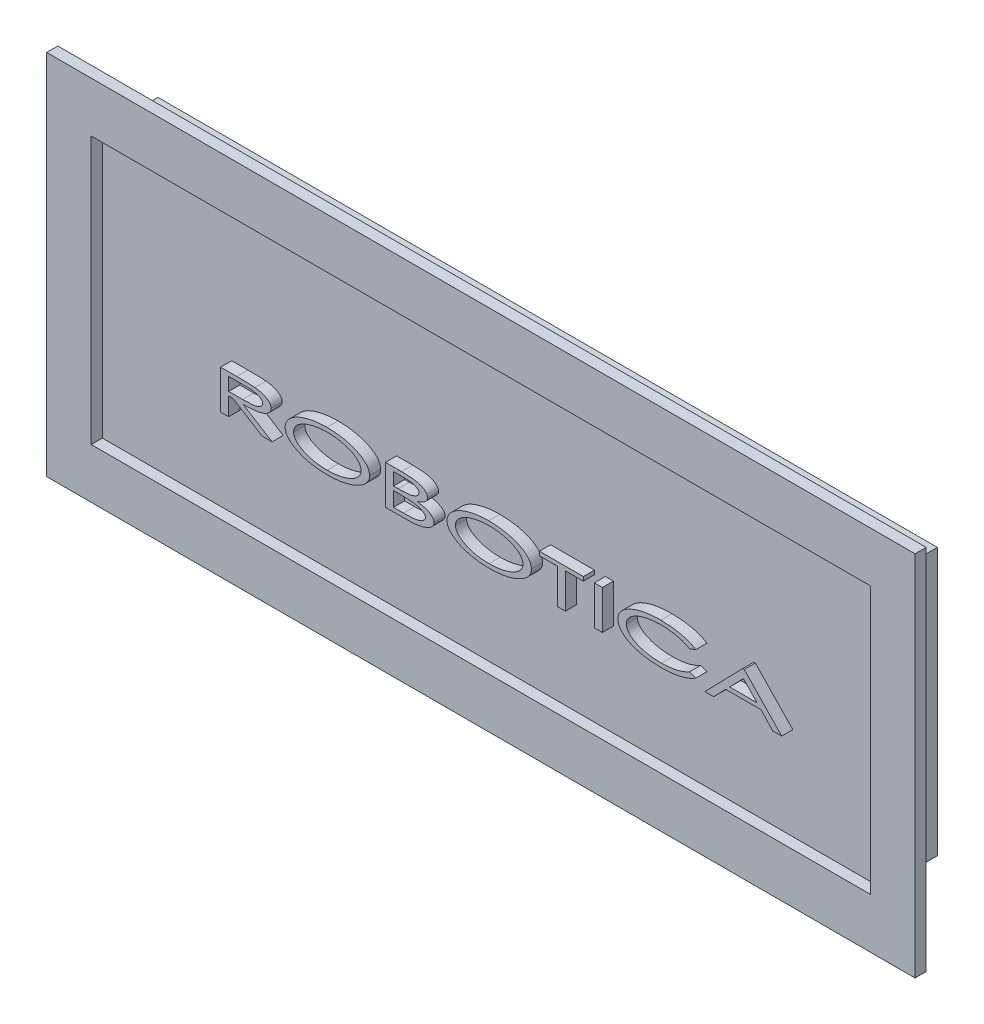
from build123d import *

# Parameters (mm, degrees)
CROQUIS1_W              = 70
CROQUIS1_H              = 24
SALIENTE_EXTRUIR1_DEPTH = 5
CROQUIS2_W              = 0.717948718
CROQUIS2_H              = 3.5
SALIENTE_EXTRUIR2_DEPTH = 1
CROQUIS3_W              = 78
CROQUIS3_H              = 33
CROQUIS3_W_2            = 70
CROQUIS3_H_2            = 24
SALIENTE_EXTRUIR3_DEPTH = 1


with BuildPart() as part:
    # Croquis1 → Saliente-Extruir1 (new body)
    with BuildSketch(Plane.XY):
        Rectangle(CROQUIS1_W, CROQUIS1_H)
    extrude(amount=SALIENTE_EXTRUIR1_DEPTH)

    # Croquis2 → Saliente-Extruir2 (add)
    # profile 1 of 8: a face of its own
    with BuildSketch(Plane.XY.offset(5)):
        with BuildLine():
            Line((-23.370996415, -0.16770114), (-21.92738664, -0.16770114))
            add(Edge.make_bspline(
                [(-21.92738664, -0.16770114), (-21.878074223, -0.167631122), (-21.781552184, -0.167494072), (-21.639926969, -0.168473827), (-21.504373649, -0.16892805), (-21.374896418, -0.17031254), (-21.25127106, -0.172586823), (-21.133949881, -0.174677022), (-21.02246308, -0.176628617), (-20.917288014, -0.179353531), (-20.817975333, -0.183051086), (-20.72495945, -0.186542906), (-20.638001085, -0.189859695), (-20.557126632, -0.194010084), (-20.482367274, -0.199134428), (-20.413609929, -0.20370786), (-20.351006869, -0.209520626), (-20.311298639, -0.213486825), (-20.292370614, -0.215377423)],
                knots=[0, 0, 0, 0, 1.446554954, 2.831425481, 4.154595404, 5.422975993, 6.629756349, 7.781699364, 8.865096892, 9.900672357, 10.867935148, 11.780388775, 12.631187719, 13.420666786, 14.155795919, 14.829367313, 15.441985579, 16, 16, 16, 16], degree=3))
            add(Edge.make_bspline(
                [(-20.292370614, -0.215377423), (-20.239717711, -0.221667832), (-20.136659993, -0.233980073), (-19.986553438, -0.260268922), (-19.843866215, -0.291090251), (-19.708613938, -0.32629599), (-19.581206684, -0.368014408), (-19.461131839, -0.414282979), (-19.348025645, -0.464864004), (-19.244183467, -0.521816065), (-19.149149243, -0.581019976), (-19.066983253, -0.645775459), (-18.996566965, -0.713154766), (-18.939024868, -0.784410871), (-18.894315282, -0.859238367), (-18.862114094, -0.937583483), (-18.842544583, -1.019540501), (-18.840149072, -1.075549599), (-18.838945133, -1.103698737)],
                knots=[0, 0, 0, 0, 1.380520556, 2.702097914, 3.966100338, 5.180878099, 6.339358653, 7.454764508, 8.530505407, 9.562535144, 10.536583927, 11.442314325, 12.28149152, 13.069345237, 13.819715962, 14.542946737, 15.26771195, 16, 16, 16, 16], degree=3))
            add(Edge.make_bspline(
                [(-18.838945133, -1.103698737), (-18.839669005, -1.127373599), (-18.841107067, -1.174406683), (-18.855285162, -1.243574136), (-18.87665269, -1.310740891), (-18.908486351, -1.375055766), (-18.947572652, -1.437623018), (-18.996212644, -1.497670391), (-19.052949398, -1.555988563), (-19.119183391, -1.610990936), (-19.192970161, -1.663372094), (-19.273909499, -1.713643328), (-19.363018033, -1.759400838), (-19.459232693, -1.802212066), (-19.563012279, -1.841479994), (-19.67413538, -1.877754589), (-19.79298956, -1.91066409), (-19.919966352, -1.940308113), (-20.056873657, -1.965975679), (-20.20500962, -1.98950754), (-20.365797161, -2.007681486), (-20.538744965, -2.023991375), (-20.724145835, -2.036409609), (-20.92190656, -2.045381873), (-21.132048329, -2.051037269), (-21.276274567, -2.051882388), (-21.350363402, -2.052316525)],
                knots=[0, 0, 0, 0, 0.585034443, 1.162244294, 1.740062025, 2.324524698, 2.932538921, 3.561952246, 4.232540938, 4.942531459, 5.688640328, 6.470118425, 7.297704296, 8.164845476, 9.074421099, 10.041713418, 11.055995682, 12.124753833, 13.266725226, 14.501606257, 15.834907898, 17.269296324, 18.799348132, 20.431667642, 22.166952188, 24, 24, 24, 24], degree=3))
            Line((-21.350363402, -2.052316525), (-18.749201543, -3.66770114))
            Line((-18.749201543, -3.66770114), (-19.658556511, -3.66770114))
            Line((-19.658556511, -3.66770114), (-22.259017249, -2.052316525))
            Line((-22.259017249, -2.052316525), (-22.653047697, -2.052316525))
            Line((-22.653047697, -2.052316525), (-22.653047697, -3.66770114))
            Line((-22.653047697, -3.66770114), (-23.370996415, -3.66770114))
            Line((-23.370996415, -3.66770114), (-23.370996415, -0.16770114))
        make_face()
        with BuildLine():
            Line((-22.653047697, -0.526675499), (-22.653047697, -1.693342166))
            Line((-22.653047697, -1.693342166), (-21.40785539, -1.698250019))
            add(Edge.make_bspline(
                [(-21.40785539, -1.698250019), (-21.349425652, -1.698268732), (-21.23676096, -1.698304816), (-21.073634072, -1.694279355), (-20.922159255, -1.689762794), (-20.782370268, -1.682832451), (-20.654487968, -1.673854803), (-20.538519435, -1.662714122), (-20.434184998, -1.649689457), (-20.340420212, -1.634104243), (-20.254790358, -1.616407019), (-20.175077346, -1.596070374), (-20.09997077, -1.573686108), (-20.029596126, -1.549343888), (-19.964216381, -1.522036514), (-19.903880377, -1.491865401), (-19.848249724, -1.459401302), (-19.797004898, -1.425511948), (-19.751516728, -1.388883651), (-19.711316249, -1.35160146), (-19.678345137, -1.312174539), (-19.649430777, -1.273390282), (-19.628456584, -1.231922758), (-19.612811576, -1.189900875), (-19.603242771, -1.146661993), (-19.602257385, -1.117533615), (-19.601765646, -1.102997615)],
                knots=[0, 0, 0, 0, 2.053767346, 3.960090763, 5.735463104, 7.380516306, 8.879456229, 10.241289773, 11.475236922, 12.574575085, 13.581541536, 14.547878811, 15.465351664, 16.335715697, 17.16416939, 17.954049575, 18.705037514, 19.427304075, 20.111126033, 20.756147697, 21.350473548, 21.915818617, 22.452252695, 22.977242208, 23.489610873, 24, 24, 24, 24], degree=3))
            add(Edge.make_bspline(
                [(-19.601765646, -1.102997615), (-19.602168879, -1.088675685), (-19.602972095, -1.060147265), (-19.613735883, -1.018267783), (-19.629257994, -0.977373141), (-19.650183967, -0.936812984), (-19.679049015, -0.898506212), (-19.712601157, -0.860267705), (-19.753187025, -0.823859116), (-19.81592643, -0.775647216), (-19.905998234, -0.719573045), (-20.029002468, -0.664963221), (-20.166564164, -0.619311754), (-20.292759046, -0.590631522), (-20.406182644, -0.572465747), (-20.506026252, -0.560007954), (-20.61920295, -0.549615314), (-20.745472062, -0.541575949), (-20.884994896, -0.534402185), (-21.037635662, -0.529723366), (-21.203583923, -0.526871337), (-21.318577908, -0.526742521), (-21.378408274, -0.526675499)],
                knots=[0, 0, 0, 0, 0.426524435, 0.849610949, 1.282423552, 1.7318453, 2.206347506, 2.710448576, 3.248780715, 3.830741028, 5.071764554, 6.405070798, 7.839224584, 9.392952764, 10.262421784, 11.268037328, 12.396234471, 13.654921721, 15.045140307, 16.566958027, 18.213818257, 20, 20, 20, 20], degree=3))
            Line((-21.378408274, -0.526675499), (-22.653047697, -0.526675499))
        make_face(mode=Mode.SUBTRACT)
    # profile 2 of 8: a face of its own
    with BuildSketch(Plane.XY.offset(5)):
        with BuildLine():
            add(Edge.make_bspline(
                [(-13.837142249, -0.077957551), (-13.769596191, -0.078355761), (-13.636110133, -0.079142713), (-13.437872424, -0.085584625), (-13.244114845, -0.096267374), (-13.05422189, -0.109849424), (-12.86862597, -0.128938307), (-12.687031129, -0.152189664), (-12.509536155, -0.178660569), (-12.336177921, -0.209222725), (-12.167322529, -0.245404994), (-12.002364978, -0.284352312), (-11.841734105, -0.327873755), (-11.685290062, -0.375521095), (-11.533034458, -0.427360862), (-11.384849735, -0.483650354), (-11.240615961, -0.543562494), (-11.101662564, -0.608054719), (-10.968856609, -0.674778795), (-10.844150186, -0.744342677), (-10.727445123, -0.814743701), (-10.61990148, -0.887913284), (-10.520733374, -0.962835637), (-10.430337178, -1.040067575), (-10.347760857, -1.118361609), (-10.274606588, -1.199381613), (-10.209725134, -1.282202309), (-10.153659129, -1.367180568), (-10.105309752, -1.453587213), (-10.066817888, -1.542496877), (-10.036102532, -1.633147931), (-10.015733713, -1.72608898), (-10.001315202, -1.820498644), (-9.999909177, -1.884225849), (-9.999201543, -1.916298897)],
                knots=[0, 0, 0, 0, 1.404451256, 2.77550855, 4.12354312, 5.439184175, 6.733600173, 8.002367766, 9.245594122, 10.464769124, 11.661827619, 12.83577003, 13.988643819, 15.121558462, 16.235683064, 17.332246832, 18.417021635, 19.482390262, 20.516844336, 21.506606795, 22.450850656, 23.349845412, 24.209978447, 25.033806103, 25.820868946, 26.574331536, 27.301429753, 28.00631532, 28.689285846, 29.357364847, 30.018140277, 30.675942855, 31.333619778, 32, 32, 32, 32], degree=3))
            add(Edge.make_bspline(
                [(-9.999201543, -1.916298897), (-10.000009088, -1.948122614), (-10.00161279, -2.011321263), (-10.014554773, -2.105289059), (-10.036422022, -2.197227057), (-10.066658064, -2.28736913), (-10.105686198, -2.375425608), (-10.152569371, -2.462042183), (-10.209346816, -2.546209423), (-10.273782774, -2.629116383), (-10.347349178, -2.709720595), (-10.428404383, -2.789390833), (-10.519905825, -2.86531868), (-10.618121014, -2.94145296), (-10.726423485, -3.013837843), (-10.841654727, -3.086699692), (-10.96701853, -3.155465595), (-11.099503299, -3.223209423), (-11.23800472, -3.288179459), (-11.381500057, -3.348046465), (-11.527933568, -3.40549152), (-11.678918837, -3.456754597), (-11.833081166, -3.505346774), (-11.991025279, -3.549820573), (-12.153083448, -3.588495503), (-12.318703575, -3.624659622), (-12.488265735, -3.655919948), (-12.661432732, -3.683576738), (-12.838534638, -3.705531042), (-13.019185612, -3.72469282), (-13.203880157, -3.739347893), (-13.392301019, -3.749758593), (-13.5844586, -3.7562604), (-13.713739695, -3.757047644), (-13.77894914, -3.75744473)],
                knots=[0, 0, 0, 0, 0.669935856, 1.330424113, 1.992907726, 2.657417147, 3.329482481, 4.018768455, 4.728515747, 5.464858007, 6.227899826, 7.024847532, 7.855964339, 8.730016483, 9.640440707, 10.597663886, 11.600009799, 12.649844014, 13.730831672, 14.820321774, 15.923398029, 17.04237603, 18.177043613, 19.326902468, 20.496630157, 21.684845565, 22.896193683, 24.126791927, 25.376896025, 26.653502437, 27.951900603, 29.277763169, 30.626902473, 32, 32, 32, 32], degree=3))
            add(Edge.make_bspline(
                [(-13.77894914, -3.75744473), (-13.845093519, -3.757050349), (-13.976010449, -3.756269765), (-14.170269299, -3.749759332), (-14.360567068, -3.739397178), (-14.546837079, -3.724420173), (-14.729511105, -3.706648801), (-14.908101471, -3.68340475), (-15.082871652, -3.655744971), (-15.253997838, -3.625577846), (-15.42092142, -3.589122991), (-15.58441231, -3.550585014), (-15.74340236, -3.50594207), (-15.898741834, -3.458353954), (-16.050271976, -3.406831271), (-16.197440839, -3.349482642), (-16.341305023, -3.289628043), (-16.48008858, -3.225267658), (-16.612833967, -3.158447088), (-16.737851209, -3.089149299), (-16.853836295, -3.017617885), (-16.962109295, -2.945554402), (-17.060747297, -2.870380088), (-17.15140472, -2.793970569), (-17.233975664, -2.716357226), (-17.306890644, -2.636084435), (-17.372007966, -2.554643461), (-17.428040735, -2.471036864), (-17.476425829, -2.386053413), (-17.514756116, -2.298714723), (-17.545645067, -2.210003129), (-17.56599478, -2.119141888), (-17.580423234, -2.026833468), (-17.581827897, -1.964499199), (-17.582534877, -1.93312582)],
                knots=[0, 0, 0, 0, 1.389702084, 2.750581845, 4.083318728, 5.393531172, 6.676585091, 7.939161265, 9.17674033, 10.394185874, 11.589375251, 12.766063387, 13.922840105, 15.058231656, 16.179379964, 17.284597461, 18.376205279, 19.452733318, 20.498022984, 21.498152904, 22.45484894, 23.360509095, 24.229651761, 25.058931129, 25.85085065, 26.608570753, 27.335565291, 28.039663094, 28.721209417, 29.38729738, 30.041035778, 30.691372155, 31.341356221, 32, 32, 32, 32], degree=3))
            add(Edge.make_bspline(
                [(-17.582534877, -1.93312582), (-17.581121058, -1.891408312), (-17.578293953, -1.807989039), (-17.553114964, -1.684382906), (-17.513686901, -1.562963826), (-17.458472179, -1.443964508), (-17.387594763, -1.327422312), (-17.300508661, -1.213829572), (-17.198505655, -1.101878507), (-17.080328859, -0.994169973), (-16.949911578, -0.889008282), (-16.806302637, -0.790768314), (-16.652461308, -0.696853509), (-16.486483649, -0.610412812), (-16.309411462, -0.528836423), (-16.120821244, -0.453669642), (-15.921265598, -0.383073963), (-15.71111945, -0.32033564), (-15.493399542, -0.262521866), (-15.269557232, -0.214101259), (-15.04166547, -0.17170517), (-14.809419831, -0.137511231), (-14.572776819, -0.110728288), (-14.331655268, -0.09232209), (-14.085945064, -0.079529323), (-13.920592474, -0.078484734), (-13.837142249, -0.077957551)],
                knots=[0, 0, 0, 0, 0.662251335, 1.324252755, 1.995962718, 2.687149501, 3.403610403, 4.158935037, 4.958021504, 5.806838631, 6.697047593, 7.617925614, 8.569389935, 9.559365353, 10.589532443, 11.665946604, 12.784027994, 13.95173467, 15.149671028, 16.362439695, 17.589698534, 18.832238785, 20.091595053, 21.372943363, 22.674175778, 24, 24, 24, 24], degree=3))
        make_face()
        with BuildLine():
            add(Edge.make_bspline(
                [(-13.805591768, -0.43693191), (-13.871277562, -0.437339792), (-14.002023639, -0.438151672), (-14.196537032, -0.448690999), (-14.388531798, -0.463838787), (-14.578025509, -0.485358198), (-14.764976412, -0.514489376), (-14.949569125, -0.548566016), (-15.131298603, -0.589230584), (-15.309124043, -0.636240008), (-15.481135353, -0.687056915), (-15.644208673, -0.744286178), (-15.797823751, -0.804948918), (-15.941794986, -0.870108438), (-16.075996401, -0.939453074), (-16.200698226, -1.013191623), (-16.315679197, -1.091371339), (-16.420041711, -1.174016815), (-16.513705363, -1.259399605), (-16.595582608, -1.347712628), (-16.664665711, -1.439088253), (-16.721288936, -1.532746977), (-16.765524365, -1.628851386), (-16.796126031, -1.727651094), (-16.81621455, -1.828783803), (-16.818543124, -1.897273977), (-16.819714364, -1.931723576)],
                knots=[0, 0, 0, 0, 1.295940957, 2.579540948, 3.842540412, 5.095804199, 6.341485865, 7.575159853, 8.799099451, 10.014924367, 11.203965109, 12.337146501, 13.42381915, 14.461891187, 15.453958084, 16.402992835, 17.318798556, 18.195272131, 19.027541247, 19.81732053, 20.568062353, 21.283784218, 21.973033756, 22.649766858, 23.32085161, 24, 24, 24, 24], degree=3))
            add(Edge.make_bspline(
                [(-16.819714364, -1.931723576), (-16.819064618, -1.957237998), (-16.817771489, -2.008017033), (-16.806648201, -2.083038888), (-16.790112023, -2.156929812), (-16.765208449, -2.228768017), (-16.734325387, -2.299519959), (-16.695895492, -2.36846826), (-16.651495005, -2.436435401), (-16.59865712, -2.501944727), (-16.539778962, -2.566213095), (-16.474582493, -2.629908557), (-16.400975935, -2.690259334), (-16.322075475, -2.751020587), (-16.235344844, -2.809007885), (-16.142112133, -2.86560407), (-16.042162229, -2.921334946), (-15.898632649, -2.993168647), (-15.709007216, -3.076587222), (-15.470397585, -3.162441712), (-15.220608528, -3.235673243), (-14.959397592, -3.294661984), (-14.687096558, -3.342101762), (-14.403082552, -3.374085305), (-14.108103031, -3.395404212), (-13.907527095, -3.397437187), (-13.805591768, -3.398470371)],
                knots=[0, 0, 0, 0, 0.505274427, 1.005601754, 1.499849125, 2.003593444, 2.50950405, 3.027643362, 3.5657789, 4.11612844, 4.693014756, 5.292307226, 5.92018657, 6.577758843, 7.264879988, 7.985987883, 8.738454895, 9.531612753, 11.165480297, 12.839769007, 14.552749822, 16.319757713, 18.143050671, 20.026461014, 21.980595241, 24, 24, 24, 24], degree=3))
            add(Edge.make_bspline(
                [(-13.805591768, -3.398470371), (-13.736871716, -3.397989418), (-13.600538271, -3.397035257), (-13.398040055, -3.387649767), (-13.199277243, -3.372346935), (-13.004746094, -3.350608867), (-12.813994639, -3.323000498), (-12.626926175, -3.290722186), (-12.44400735, -3.250241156), (-12.265668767, -3.205184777), (-12.094295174, -3.154209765), (-11.931262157, -3.099180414), (-11.778331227, -3.038802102), (-11.635073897, -2.974365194), (-11.501313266, -2.905911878), (-11.377776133, -2.831874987), (-11.263011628, -2.754642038), (-11.159342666, -2.671650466), (-11.066118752, -2.586067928), (-10.984903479, -2.497577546), (-10.91629816, -2.406512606), (-10.85946388, -2.313387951), (-10.816824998, -2.216911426), (-10.784285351, -2.11902825), (-10.765887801, -2.017950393), (-10.763313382, -1.949787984), (-10.762022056, -1.915597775)],
                knots=[0, 0, 0, 0, 1.346107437, 2.670537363, 3.970069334, 5.250689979, 6.504156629, 7.745322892, 8.968389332, 10.173153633, 11.347925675, 12.46995173, 13.542847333, 14.567376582, 15.546121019, 16.484378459, 17.38721925, 18.253788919, 19.083158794, 19.864150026, 20.603067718, 21.313629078, 21.996022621, 22.664906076, 23.330317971, 24, 24, 24, 24], degree=3))
            add(Edge.make_bspline(
                [(-10.762022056, -1.915597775), (-10.763313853, -1.881641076), (-10.76588928, -1.813942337), (-10.784282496, -1.713554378), (-10.816855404, -1.616389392), (-10.859306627, -1.520727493), (-10.916356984, -1.4288773), (-10.984937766, -1.339197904), (-11.066201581, -1.252170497), (-11.159405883, -1.167672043), (-11.263925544, -1.08668042), (-11.378543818, -1.009542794), (-11.503105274, -0.936486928), (-11.638040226, -0.867866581), (-11.783264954, -0.803604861), (-11.938427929, -0.743407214), (-12.103572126, -0.687270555), (-12.277714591, -0.636071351), (-12.458172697, -0.589263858), (-12.642690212, -0.54854685), (-12.829868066, -0.514575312), (-13.019593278, -0.485233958), (-13.212143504, -0.463859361), (-13.407637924, -0.448687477), (-13.605656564, -0.438153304), (-13.738737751, -0.437340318), (-13.805591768, -0.43693191)],
                knots=[0, 0, 0, 0, 0.666607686, 1.329001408, 1.995024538, 2.674767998, 3.379078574, 4.112343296, 4.888336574, 5.713367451, 6.579809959, 7.48210552, 8.424082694, 9.41319212, 10.452588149, 11.540712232, 12.679770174, 13.876084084, 15.103616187, 16.339379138, 17.584959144, 18.838046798, 20.10786645, 21.387447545, 22.687570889, 24, 24, 24, 24], degree=3))
        make_face(mode=Mode.SUBTRACT)
    # profile 3 of 8: a face of its own
    with BuildSketch(Plane.XY.offset(5)):
        with BuildLine():
            Line((-8.563304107, -0.16770114), (-7.128808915, -0.16770114))
            add(Edge.make_bspline(
                [(-7.128808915, -0.16770114), (-7.058692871, -0.167879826), (-6.922648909, -0.168226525), (-6.724914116, -0.173471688), (-6.539753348, -0.180719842), (-6.367249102, -0.192036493), (-6.207111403, -0.205976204), (-6.059493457, -0.222350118), (-5.924275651, -0.242545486), (-5.800856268, -0.266585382), (-5.686458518, -0.293408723), (-5.579395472, -0.323589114), (-5.478169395, -0.356315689), (-5.382986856, -0.392714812), (-5.294219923, -0.433419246), (-5.211336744, -0.476888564), (-5.134206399, -0.52292671), (-5.064605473, -0.573511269), (-5.001414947, -0.625561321), (-4.946422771, -0.679891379), (-4.899239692, -0.734907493), (-4.860360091, -0.791793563), (-4.831089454, -0.850690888), (-4.809672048, -0.910895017), (-4.796481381, -0.972483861), (-4.794877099, -1.014125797), (-4.794073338, -1.034988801)],
                knots=[0, 0, 0, 0, 1.875262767, 3.638513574, 5.290139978, 6.831070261, 8.261710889, 9.589120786, 10.802874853, 11.917207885, 12.951227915, 13.944642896, 14.891479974, 15.79576526, 16.668476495, 17.501678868, 18.298175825, 19.068412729, 19.800709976, 20.485814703, 21.133301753, 21.736619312, 22.32365637, 22.887090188, 23.442421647, 24, 24, 24, 24], degree=3))
            add(Edge.make_bspline(
                [(-4.794073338, -1.034988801), (-4.794712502, -1.05443564), (-4.795993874, -1.093421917), (-4.807496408, -1.151044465), (-4.827013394, -1.207069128), (-4.852921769, -1.262106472), (-4.886999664, -1.315649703), (-4.928740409, -1.367459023), (-4.977424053, -1.418252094), (-5.033611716, -1.467119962), (-5.09697406, -1.514103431), (-5.1673266, -1.558949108), (-5.244679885, -1.601611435), (-5.328826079, -1.642366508), (-5.42031755, -1.679971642), (-5.518584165, -1.715664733), (-5.623821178, -1.749399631), (-5.696803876, -1.769341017), (-5.734277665, -1.779580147)],
                knots=[0, 0, 0, 0, 0.726787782, 1.457036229, 2.186761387, 2.941346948, 3.727032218, 4.554258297, 5.425914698, 6.355056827, 7.335762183, 8.373507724, 9.472918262, 10.637884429, 11.868297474, 13.170651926, 14.547239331, 16, 16, 16, 16], degree=3))
            add(Edge.make_bspline(
                [(-5.734277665, -1.779580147), (-5.688204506, -1.78709872), (-5.598702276, -1.801704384), (-5.468709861, -1.826205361), (-5.34712313, -1.852558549), (-5.233122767, -1.877597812), (-5.128259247, -1.90630004), (-5.030978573, -1.933918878), (-4.941993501, -1.963134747), (-4.836429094, -2.003742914), (-4.717219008, -2.056973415), (-4.587928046, -2.12736976), (-4.476891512, -2.206269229), (-4.396243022, -2.27726818), (-4.341669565, -2.337327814), (-4.306866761, -2.382664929), (-4.276712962, -2.428544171), (-4.252906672, -2.475961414), (-4.233777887, -2.524217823), (-4.220388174, -2.573596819), (-4.212530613, -2.623711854), (-4.211337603, -2.657357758), (-4.210740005, -2.674211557)],
                knots=[0, 0, 0, 0, 1.475981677, 2.867258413, 4.181750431, 5.40964817, 6.556781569, 7.618482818, 8.606915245, 9.516764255, 11.193638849, 12.731703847, 14.162795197, 15.491972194, 16.119761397, 16.725731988, 17.29758256, 17.852767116, 18.40027651, 18.936245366, 19.467147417, 20, 20, 20, 20], degree=3))
            add(Edge.make_bspline(
                [(-4.210740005, -2.674211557), (-4.21253715, -2.708567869), (-4.216128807, -2.777230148), (-4.248391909, -2.877141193), (-4.299007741, -2.972641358), (-4.371009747, -3.063151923), (-4.462720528, -3.149275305), (-4.573426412, -3.232118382), (-4.704655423, -3.30949999), (-4.85371625, -3.383369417), (-5.02009948, -3.449750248), (-5.200692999, -3.509069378), (-5.395412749, -3.557263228), (-5.603377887, -3.598101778), (-5.825043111, -3.629306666), (-6.060419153, -3.651169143), (-6.309245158, -3.665841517), (-6.479781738, -3.667070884), (-6.567210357, -3.66770114)],
                knots=[0, 0, 0, 0, 0.59620673, 1.191539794, 1.807981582, 2.468259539, 3.192804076, 3.991163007, 4.868159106, 5.838927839, 6.882127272, 7.981209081, 9.142600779, 10.368710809, 11.666197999, 13.034158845, 14.479508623, 16, 16, 16, 16], degree=3))
            Line((-6.567210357, -3.66770114), (-8.563304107, -3.66770114))
            Line((-8.563304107, -3.66770114), (-8.563304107, -0.16770114))
        make_face()
        with BuildLine():
            Line((-7.84535539, -0.526675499), (-7.84535539, -1.648470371))
            Line((-7.84535539, -1.648470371), (-7.431693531, -1.648470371))
            add(Edge.make_bspline(
                [(-7.431693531, -1.648470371), (-7.371163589, -1.648070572), (-7.254070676, -1.647297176), (-7.084591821, -1.645079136), (-6.927555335, -1.638951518), (-6.783044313, -1.632602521), (-6.650970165, -1.622702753), (-6.531322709, -1.610667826), (-6.423832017, -1.598071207), (-6.327781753, -1.581547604), (-6.240172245, -1.562917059), (-6.158160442, -1.542925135), (-6.080892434, -1.519868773), (-6.008512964, -1.493686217), (-5.940554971, -1.46586342), (-5.876971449, -1.435694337), (-5.818264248, -1.402778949), (-5.764130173, -1.367997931), (-5.716026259, -1.330935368), (-5.673521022, -1.293048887), (-5.637237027, -1.253962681), (-5.608853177, -1.212822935), (-5.584726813, -1.172112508), (-5.568425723, -1.129476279), (-5.559288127, -1.085623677), (-5.557691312, -1.056062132), (-5.556893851, -1.041298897)],
                knots=[0, 0, 0, 0, 2.059552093, 3.984126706, 5.766443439, 7.406422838, 8.905482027, 10.271925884, 11.497881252, 12.58682896, 13.586500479, 14.545002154, 15.458202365, 16.32846878, 17.162791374, 17.955931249, 18.721321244, 19.451363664, 20.143207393, 20.785082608, 21.387368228, 21.952162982, 22.482786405, 22.993741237, 23.497467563, 24, 24, 24, 24], degree=3))
            add(Edge.make_bspline(
                [(-5.556893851, -1.041298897), (-5.5580164, -1.021795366), (-5.560246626, -0.983046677), (-5.576916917, -0.92661877), (-5.605163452, -0.873970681), (-5.64357684, -0.824494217), (-5.692840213, -0.778489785), (-5.753398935, -0.736576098), (-5.824400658, -0.697522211), (-5.906550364, -0.661727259), (-6.000295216, -0.629592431), (-6.106632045, -0.601527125), (-6.225817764, -0.579386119), (-6.357601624, -0.559138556), (-6.502310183, -0.545478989), (-6.65982698, -0.53377325), (-6.830086, -0.527865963), (-6.947916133, -0.527081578), (-7.008917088, -0.526675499)],
                knots=[0, 0, 0, 0, 0.561802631, 1.116162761, 1.67974019, 2.275388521, 2.91406491, 3.615054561, 4.393138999, 5.24688731, 6.195054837, 7.247504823, 8.41425707, 9.688211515, 11.090028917, 12.603070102, 14.241400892, 16, 16, 16, 16], degree=3))
            Line((-7.008917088, -0.526675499), (-7.84535539, -0.526675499))
        make_face(mode=Mode.SUBTRACT)
        with BuildLine():
            Line((-7.84535539, -2.00744473), (-7.84535539, -3.308726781))
            Line((-7.84535539, -3.308726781), (-6.950723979, -3.308726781))
            add(Edge.make_bspline(
                [(-6.950723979, -3.308726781), (-6.886921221, -3.308345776), (-6.763750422, -3.307610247), (-6.585404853, -3.305146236), (-6.42035725, -3.299814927), (-6.268478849, -3.290917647), (-6.129999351, -3.281875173), (-6.004712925, -3.269051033), (-5.892677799, -3.254608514), (-5.792245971, -3.237921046), (-5.701010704, -3.217504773), (-5.615471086, -3.196210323), (-5.534520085, -3.171589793), (-5.458150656, -3.144099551), (-5.385828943, -3.114995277), (-5.318316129, -3.082792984), (-5.255855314, -3.047413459), (-5.197648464, -3.01073624), (-5.145486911, -2.971703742), (-5.099516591, -2.932077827), (-5.061358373, -2.890865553), (-5.029413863, -2.849613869), (-5.004275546, -2.807102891), (-4.986866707, -2.763568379), (-4.975512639, -2.719190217), (-4.974212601, -2.689236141), (-4.973560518, -2.674211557)],
                knots=[0, 0, 0, 0, 2.066779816, 3.989904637, 5.777549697, 7.415281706, 8.917966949, 10.272373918, 11.494029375, 12.576811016, 13.568738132, 14.521679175, 15.431705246, 16.308109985, 17.150197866, 17.956083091, 18.728896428, 19.474419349, 20.183012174, 20.837492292, 21.437421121, 21.999164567, 22.525022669, 23.03110956, 23.514016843, 24, 24, 24, 24], degree=3))
            add(Edge.make_bspline(
                [(-4.973560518, -2.674211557), (-4.974509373, -2.655653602), (-4.976413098, -2.61842005), (-4.991862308, -2.563770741), (-5.017033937, -2.511154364), (-5.051601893, -2.46038078), (-5.097145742, -2.412264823), (-5.151769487, -2.365672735), (-5.216097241, -2.320618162), (-5.289853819, -2.27842035), (-5.371613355, -2.237708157), (-5.461465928, -2.200839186), (-5.55871102, -2.167286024), (-5.663013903, -2.136485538), (-5.774859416, -2.109184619), (-5.893955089, -2.085548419), (-6.020512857, -2.065239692), (-6.107471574, -2.054386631), (-6.152146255, -2.048810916)],
                knots=[0, 0, 0, 0, 0.622368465, 1.248682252, 1.891062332, 2.574501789, 3.301937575, 4.108840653, 4.981872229, 5.934798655, 6.959559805, 8.046720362, 9.193291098, 10.41246007, 11.697172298, 13.057638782, 14.488374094, 16, 16, 16, 16], degree=3))
            add(Edge.make_bspline(
                [(-6.152146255, -2.048810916), (-6.185784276, -2.045358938), (-6.258582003, -2.037888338), (-6.376672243, -2.029898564), (-6.511539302, -2.022927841), (-6.663714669, -2.017686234), (-6.832670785, -2.012339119), (-7.018964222, -2.01020533), (-7.222051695, -2.007721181), (-7.363216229, -2.007539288), (-7.436601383, -2.00744473)],
                knots=[0, 0, 0, 0, 0.631213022, 1.366039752, 2.209199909, 3.152222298, 4.208474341, 5.364762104, 6.630057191, 8, 8, 8, 8], degree=3))
            Line((-7.436601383, -2.00744473), (-7.84535539, -2.00744473))
        make_face(mode=Mode.SUBTRACT)
    # profile 4 of 8: a face of its own
    with BuildSketch(Plane.XY.offset(5)):
        with BuildLine():
            add(Edge.make_bspline(
                [(0.70131929, -0.077957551), (0.768865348, -0.078355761), (0.902351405, -0.079142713), (1.100589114, -0.085584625), (1.294346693, -0.096267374), (1.484239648, -0.109849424), (1.669835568, -0.128938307), (1.851430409, -0.152189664), (2.028925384, -0.178660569), (2.202283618, -0.209222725), (2.371139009, -0.245404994), (2.536096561, -0.284352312), (2.696727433, -0.327873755), (2.853171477, -0.375521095), (3.005427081, -0.427360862), (3.153611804, -0.483650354), (3.297845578, -0.543562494), (3.436798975, -0.608054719), (3.569604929, -0.674778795), (3.694311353, -0.744342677), (3.811016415, -0.814743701), (3.918560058, -0.887913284), (4.017728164, -0.962835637), (4.10812436, -1.040067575), (4.190700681, -1.118361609), (4.263854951, -1.199381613), (4.328736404, -1.282202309), (4.384802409, -1.367180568), (4.433151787, -1.453587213), (4.471643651, -1.542496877), (4.502359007, -1.633147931), (4.522727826, -1.72608898), (4.537146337, -1.820498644), (4.538552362, -1.884225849), (4.539259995, -1.916298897)],
                knots=[0, 0, 0, 0, 1.404451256, 2.77550855, 4.12354312, 5.439184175, 6.733600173, 8.002367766, 9.245594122, 10.464769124, 11.661827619, 12.83577003, 13.988643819, 15.121558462, 16.235683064, 17.332246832, 18.417021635, 19.482390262, 20.516844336, 21.506606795, 22.450850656, 23.349845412, 24.209978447, 25.033806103, 25.820868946, 26.574331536, 27.301429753, 28.00631532, 28.689285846, 29.357364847, 30.018140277, 30.675942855, 31.333619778, 32, 32, 32, 32], degree=3))
            add(Edge.make_bspline(
                [(4.539259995, -1.916298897), (4.53845245, -1.948122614), (4.536848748, -2.011321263), (4.523906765, -2.105289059), (4.502039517, -2.197227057), (4.471803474, -2.28736913), (4.43277534, -2.375425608), (4.385892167, -2.462042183), (4.329114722, -2.546209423), (4.264678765, -2.629116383), (4.191112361, -2.709720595), (4.110057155, -2.789390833), (4.018555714, -2.86531868), (3.920340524, -2.94145296), (3.812038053, -3.013837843), (3.696806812, -3.086699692), (3.571443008, -3.155465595), (3.43895824, -3.223209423), (3.300456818, -3.288179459), (3.156961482, -3.348046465), (3.01052797, -3.40549152), (2.859542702, -3.456754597), (2.705380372, -3.505346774), (2.54743626, -3.549820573), (2.385378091, -3.588495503), (2.219757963, -3.624659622), (2.050195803, -3.655919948), (1.877028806, -3.683576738), (1.699926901, -3.705531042), (1.519275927, -3.72469282), (1.334581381, -3.739347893), (1.14616052, -3.749758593), (0.954002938, -3.7562604), (0.824721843, -3.757047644), (0.759512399, -3.75744473)],
                knots=[0, 0, 0, 0, 0.669935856, 1.330424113, 1.992907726, 2.657417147, 3.329482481, 4.018768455, 4.728515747, 5.464858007, 6.227899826, 7.024847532, 7.855964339, 8.730016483, 9.640440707, 10.597663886, 11.600009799, 12.649844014, 13.730831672, 14.820321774, 15.923398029, 17.04237603, 18.177043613, 19.326902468, 20.496630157, 21.684845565, 22.896193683, 24.126791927, 25.376896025, 26.653502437, 27.951900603, 29.277763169, 30.626902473, 32, 32, 32, 32], degree=3))
            add(Edge.make_bspline(
                [(0.759512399, -3.75744473), (0.693368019, -3.757050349), (0.562451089, -3.756269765), (0.368192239, -3.749759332), (0.177894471, -3.739397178), (-0.00837554, -3.724420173), (-0.191049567, -3.706648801), (-0.369639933, -3.68340475), (-0.544410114, -3.655744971), (-0.715536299, -3.625577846), (-0.882459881, -3.589122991), (-1.045950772, -3.550585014), (-1.204940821, -3.50594207), (-1.360280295, -3.458353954), (-1.511810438, -3.406831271), (-1.658979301, -3.349482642), (-1.802843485, -3.289628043), (-1.941627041, -3.225267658), (-2.074372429, -3.158447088), (-2.199389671, -3.089149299), (-2.315374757, -3.017617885), (-2.423647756, -2.945554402), (-2.522285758, -2.870380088), (-2.612943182, -2.793970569), (-2.695514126, -2.716357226), (-2.768429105, -2.636084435), (-2.833546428, -2.554643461), (-2.889579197, -2.471036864), (-2.937964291, -2.386053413), (-2.976294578, -2.298714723), (-3.007183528, -2.210003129), (-3.027533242, -2.119141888), (-3.041961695, -2.026833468), (-3.043366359, -1.964499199), (-3.044073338, -1.93312582)],
                knots=[0, 0, 0, 0, 1.389702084, 2.750581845, 4.083318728, 5.393531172, 6.676585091, 7.939161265, 9.17674033, 10.394185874, 11.589375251, 12.766063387, 13.922840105, 15.058231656, 16.179379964, 17.284597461, 18.376205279, 19.452733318, 20.498022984, 21.498152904, 22.45484894, 23.360509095, 24.229651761, 25.058931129, 25.85085065, 26.608570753, 27.335565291, 28.039663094, 28.721209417, 29.38729738, 30.041035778, 30.691372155, 31.341356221, 32, 32, 32, 32], degree=3))
            add(Edge.make_bspline(
                [(-3.044073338, -1.93312582), (-3.042659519, -1.891408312), (-3.039832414, -1.807989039), (-3.014653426, -1.684382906), (-2.975225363, -1.562963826), (-2.920010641, -1.443964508), (-2.849133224, -1.327422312), (-2.762047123, -1.213829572), (-2.660044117, -1.101878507), (-2.541867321, -0.994169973), (-2.411450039, -0.889008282), (-2.267841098, -0.790768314), (-2.113999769, -0.696853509), (-1.948022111, -0.610412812), (-1.770949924, -0.528836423), (-1.582359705, -0.453669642), (-1.382804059, -0.383073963), (-1.172657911, -0.32033564), (-0.954938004, -0.262521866), (-0.731095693, -0.214101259), (-0.503203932, -0.17170517), (-0.270958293, -0.137511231), (-0.034315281, -0.110728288), (0.206806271, -0.09232209), (0.452516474, -0.079529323), (0.617869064, -0.078484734), (0.70131929, -0.077957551)],
                knots=[0, 0, 0, 0, 0.662251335, 1.324252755, 1.995962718, 2.687149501, 3.403610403, 4.158935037, 4.958021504, 5.806838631, 6.697047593, 7.617925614, 8.569389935, 9.559365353, 10.589532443, 11.665946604, 12.784027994, 13.95173467, 15.149671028, 16.362439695, 17.589698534, 18.832238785, 20.091595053, 21.372943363, 22.674175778, 24, 24, 24, 24], degree=3))
        make_face()
        with BuildLine():
            add(Edge.make_bspline(
                [(0.732869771, -0.43693191), (0.667183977, -0.437339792), (0.5364379, -0.438151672), (0.341924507, -0.448690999), (0.149929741, -0.463838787), (-0.03956397, -0.485358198), (-0.226514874, -0.514489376), (-0.411107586, -0.548566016), (-0.592837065, -0.589230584), (-0.770662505, -0.636240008), (-0.942673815, -0.687056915), (-1.105747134, -0.744286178), (-1.259362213, -0.804948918), (-1.403333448, -0.870108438), (-1.537534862, -0.939453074), (-1.662236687, -1.013191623), (-1.777217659, -1.091371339), (-1.881580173, -1.174016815), (-1.975243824, -1.259399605), (-2.057121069, -1.347712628), (-2.126204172, -1.439088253), (-2.182827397, -1.532746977), (-2.227062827, -1.628851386), (-2.257664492, -1.727651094), (-2.277753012, -1.828783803), (-2.280081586, -1.897273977), (-2.281252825, -1.931723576)],
                knots=[0, 0, 0, 0, 1.295940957, 2.579540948, 3.842540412, 5.095804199, 6.341485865, 7.575159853, 8.799099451, 10.014924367, 11.203965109, 12.337146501, 13.42381915, 14.461891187, 15.453958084, 16.402992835, 17.318798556, 18.195272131, 19.027541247, 19.81732053, 20.568062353, 21.283784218, 21.973033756, 22.649766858, 23.32085161, 24, 24, 24, 24], degree=3))
            add(Edge.make_bspline(
                [(-2.281252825, -1.931723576), (-2.28060308, -1.957237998), (-2.279309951, -2.008017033), (-2.268186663, -2.083038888), (-2.251650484, -2.156929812), (-2.22674691, -2.228768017), (-2.195863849, -2.299519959), (-2.157433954, -2.36846826), (-2.113033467, -2.436435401), (-2.060195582, -2.501944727), (-2.001317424, -2.566213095), (-1.936120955, -2.629908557), (-1.862514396, -2.690259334), (-1.783613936, -2.751020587), (-1.696883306, -2.809007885), (-1.603650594, -2.86560407), (-1.50370069, -2.921334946), (-1.360171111, -2.993168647), (-1.170545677, -3.076587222), (-0.931936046, -3.162441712), (-0.68214699, -3.235673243), (-0.420936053, -3.294661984), (-0.148635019, -3.342101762), (0.135378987, -3.374085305), (0.430358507, -3.395404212), (0.630934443, -3.397437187), (0.732869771, -3.398470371)],
                knots=[0, 0, 0, 0, 0.505274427, 1.005601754, 1.499849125, 2.003593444, 2.50950405, 3.027643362, 3.5657789, 4.11612844, 4.693014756, 5.292307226, 5.92018657, 6.577758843, 7.264879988, 7.985987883, 8.738454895, 9.531612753, 11.165480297, 12.839769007, 14.552749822, 16.319757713, 18.143050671, 20.026461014, 21.980595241, 24, 24, 24, 24], degree=3))
            add(Edge.make_bspline(
                [(0.732869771, -3.398470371), (0.801589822, -3.397989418), (0.937923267, -3.397035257), (1.140421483, -3.387649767), (1.339184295, -3.372346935), (1.533715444, -3.350608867), (1.724466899, -3.323000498), (1.911535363, -3.290722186), (2.094454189, -3.250241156), (2.272792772, -3.205184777), (2.444166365, -3.154209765), (2.607199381, -3.099180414), (2.760130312, -3.038802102), (2.903387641, -2.974365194), (3.037148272, -2.905911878), (3.160685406, -2.831874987), (3.27544991, -2.754642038), (3.379118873, -2.671650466), (3.472342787, -2.586067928), (3.55355806, -2.497577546), (3.622163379, -2.406512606), (3.678997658, -2.313387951), (3.721636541, -2.216911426), (3.754176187, -2.11902825), (3.772573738, -2.017950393), (3.775148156, -1.949787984), (3.776439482, -1.915597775)],
                knots=[0, 0, 0, 0, 1.346107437, 2.670537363, 3.970069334, 5.250689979, 6.504156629, 7.745322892, 8.968389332, 10.173153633, 11.347925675, 12.46995173, 13.542847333, 14.567376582, 15.546121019, 16.484378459, 17.38721925, 18.253788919, 19.083158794, 19.864150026, 20.603067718, 21.313629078, 21.996022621, 22.664906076, 23.330317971, 24, 24, 24, 24], degree=3))
            add(Edge.make_bspline(
                [(3.776439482, -1.915597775), (3.775147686, -1.881641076), (3.772572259, -1.813942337), (3.754179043, -1.713554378), (3.721606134, -1.616389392), (3.679154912, -1.520727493), (3.622104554, -1.4288773), (3.553523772, -1.339197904), (3.472259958, -1.252170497), (3.379055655, -1.167672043), (3.274535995, -1.08668042), (3.159917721, -1.009542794), (3.035356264, -0.936486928), (2.900421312, -0.867866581), (2.755196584, -0.803604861), (2.600033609, -0.743407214), (2.434889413, -0.687270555), (2.260746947, -0.636071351), (2.080288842, -0.589263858), (1.895771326, -0.54854685), (1.708593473, -0.514575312), (1.51886826, -0.485233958), (1.326318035, -0.463859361), (1.130823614, -0.448687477), (0.932804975, -0.438153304), (0.799723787, -0.437340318), (0.732869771, -0.43693191)],
                knots=[0, 0, 0, 0, 0.666607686, 1.329001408, 1.995024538, 2.674767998, 3.379078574, 4.112343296, 4.888336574, 5.713367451, 6.579809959, 7.48210552, 8.424082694, 9.41319212, 10.452588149, 11.540712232, 12.679770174, 13.876084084, 15.103616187, 16.339379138, 17.584959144, 18.838046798, 20.10786645, 21.387447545, 22.687570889, 24, 24, 24, 24], degree=3))
        make_face(mode=Mode.SUBTRACT)
    # profile 5 of 8: a face of its own
    with BuildSketch(Plane.XY.offset(5)):
        Polygon((5.257208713, -0.526675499), (5.257208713, -0.16770114), (9.205926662, -0.16770114), (9.205926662, -0.526675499), (7.590542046, -0.526675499), (7.590542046, -3.66770114), (6.872593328, -3.66770114), (6.872593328, -0.526675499), align=None)
    # profile 6 of 8: a face of its own
    with BuildSketch(Plane.XY.offset(5)):
        with Locations((10.552080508, -1.91770114)):
            Rectangle(CROQUIS2_W, CROQUIS2_H)
    # profile 7 of 8: a face of its own
    with BuildSketch(Plane.XY.offset(5)):
        with BuildLine():
            Line((19.302080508, -0.809928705), (18.73276961, -1.020265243))
            add(Edge.make_bspline(
                [(18.73276961, -1.020265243), (18.693271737, -0.996714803), (18.613273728, -0.94901633), (18.48752638, -0.88434886), (18.356160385, -0.823115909), (18.218885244, -0.766374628), (18.075570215, -0.714676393), (17.926825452, -0.667005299), (17.772259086, -0.623460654), (17.6120077, -0.584486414), (17.446973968, -0.549447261), (17.277687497, -0.519223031), (17.104360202, -0.494283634), (16.926964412, -0.472980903), (16.745252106, -0.457201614), (16.559658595, -0.445145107), (16.370046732, -0.437971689), (16.24239105, -0.437280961), (16.17788179, -0.43693191)],
                knots=[0, 0, 0, 0, 0.832057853, 1.685229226, 2.557559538, 3.454549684, 4.372387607, 5.314045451, 6.28078757, 7.277890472, 8.298216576, 9.333631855, 10.389364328, 11.466932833, 12.566692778, 13.68982298, 14.832579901, 16, 16, 16, 16], degree=3))
            add(Edge.make_bspline(
                [(16.17788179, -0.43693191), (16.107288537, -0.437327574), (15.967433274, -0.438111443), (15.759607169, -0.448722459), (15.555682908, -0.46369764), (15.355729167, -0.485385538), (15.159873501, -0.513783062), (14.96766607, -0.546760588), (14.779644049, -0.58809117), (14.596316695, -0.633513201), (14.420308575, -0.685371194), (14.253256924, -0.741328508), (14.096314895, -0.801198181), (13.949879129, -0.865919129), (13.813628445, -0.934619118), (13.686960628, -1.007145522), (13.571340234, -1.085174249), (13.465834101, -1.166275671), (13.371648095, -1.250765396), (13.290067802, -1.338586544), (13.220177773, -1.428696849), (13.164235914, -1.522452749), (13.119074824, -1.617957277), (13.088317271, -1.716867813), (13.068468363, -1.818046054), (13.0660922, -1.886760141), (13.064901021, -1.921206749)],
                knots=[0, 0, 0, 0, 1.35894126, 2.692255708, 4.005320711, 5.295216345, 6.563387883, 7.815000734, 9.048758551, 10.268796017, 11.450523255, 12.580260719, 13.659856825, 14.683193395, 15.661129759, 16.596487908, 17.491248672, 18.344429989, 19.156782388, 19.924073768, 20.649414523, 21.347751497, 22.022137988, 22.678142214, 23.337348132, 24, 24, 24, 24], degree=3))
            add(Edge.make_bspline(
                [(13.064901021, -1.921206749), (13.06558574, -1.947180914), (13.066954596, -1.999107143), (13.077639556, -2.075908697), (13.095482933, -2.151173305), (13.119874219, -2.22472738), (13.151821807, -2.296653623), (13.190378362, -2.366880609), (13.236383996, -2.43518873), (13.289238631, -2.501662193), (13.348342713, -2.567379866), (13.415008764, -2.630988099), (13.48908034, -2.692633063), (13.56959449, -2.753133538), (13.657835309, -2.81072619), (13.751439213, -2.869096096), (13.853847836, -2.922947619), (13.999370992, -2.995951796), (14.194245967, -3.078054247), (14.440580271, -3.164825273), (14.702085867, -3.236195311), (14.977705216, -3.296081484), (15.268012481, -3.341935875), (15.573164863, -3.374298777), (15.892693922, -3.395423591), (16.110773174, -3.397440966), (16.222052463, -3.398470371)],
                knots=[0, 0, 0, 0, 0.494370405, 0.98832018, 1.472882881, 1.965327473, 2.461356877, 2.969139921, 3.488658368, 4.027186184, 4.58476761, 5.170079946, 5.779630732, 6.418547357, 7.086146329, 7.785121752, 8.517686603, 9.28773273, 10.884402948, 12.539210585, 14.256613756, 16.041261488, 17.90652187, 19.848797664, 21.881766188, 24, 24, 24, 24], degree=3))
            add(Edge.make_bspline(
                [(16.222052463, -3.398470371), (16.283992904, -3.398146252), (16.406512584, -3.397505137), (16.588375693, -3.389979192), (16.766334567, -3.379235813), (16.940461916, -3.362754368), (17.11097906, -3.342795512), (17.277617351, -3.317312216), (17.440473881, -3.288238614), (17.599116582, -3.253505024), (17.754290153, -3.215259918), (17.905487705, -3.171638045), (18.053179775, -3.124097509), (18.196663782, -3.071414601), (18.336664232, -3.014698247), (18.47239995, -2.952877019), (18.604833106, -2.887219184), (18.690203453, -2.839119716), (18.73276961, -2.815137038)],
                knots=[0, 0, 0, 0, 1.140222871, 2.255388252, 3.35037711, 4.421964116, 5.47487885, 6.510510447, 7.524904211, 8.519850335, 9.499695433, 10.466551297, 11.41625365, 12.355430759, 13.279827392, 14.196360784, 15.100694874, 16, 16, 16, 16], degree=3))
            Line((18.73276961, -2.815137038), (19.302080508, -3.023370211))
            add(Edge.make_bspline(
                [(19.302080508, -3.023370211), (19.25631107, -3.05210254), (19.163315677, -3.110481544), (19.01678627, -3.19071783), (18.862044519, -3.265872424), (18.698829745, -3.335883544), (18.527538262, -3.401805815), (18.347711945, -3.461798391), (18.159982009, -3.517408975), (17.964217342, -3.567572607), (17.761282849, -3.612445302), (17.552140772, -3.650743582), (17.337276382, -3.683724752), (17.116589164, -3.711097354), (16.890015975, -3.732110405), (16.657594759, -3.746465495), (16.419382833, -3.756076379), (16.258520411, -3.756985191), (16.177180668, -3.75744473)],
                knots=[0, 0, 0, 0, 0.79749538, 1.620369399, 2.464253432, 3.33571117, 4.240903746, 5.172469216, 6.132951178, 7.130228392, 8.154650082, 9.199958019, 10.267878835, 11.362763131, 12.481742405, 13.62581771, 14.799499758, 16, 16, 16, 16], degree=3))
            add(Edge.make_bspline(
                [(16.177180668, -3.75744473), (16.099815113, -3.757190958), (15.947380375, -3.756690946), (15.721828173, -3.748236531), (15.502514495, -3.736889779), (15.289136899, -3.719620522), (15.081865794, -3.6993732), (14.880940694, -3.672082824), (14.686298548, -3.641794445), (14.497866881, -3.605834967), (14.315677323, -3.565331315), (14.139539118, -3.519889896), (13.969701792, -3.469071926), (13.805720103, -3.414945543), (13.648172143, -3.355009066), (13.496778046, -3.290623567), (13.351263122, -3.221568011), (13.258179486, -3.170584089), (13.212136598, -3.145365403)],
                knots=[0, 0, 0, 0, 1.213580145, 2.39113869, 3.54036773, 4.658377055, 5.749147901, 6.806911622, 7.838817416, 8.839006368, 9.815662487, 10.766248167, 11.69191758, 12.596227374, 13.474607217, 14.335357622, 15.176601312, 16, 16, 16, 16], degree=3))
            add(Edge.make_bspline(
                [(13.212136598, -3.145365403), (13.175231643, -3.123978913), (13.102818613, -3.082015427), (12.999955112, -3.014395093), (12.903487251, -2.945832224), (12.814491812, -2.875212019), (12.73291729, -2.802527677), (12.657774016, -2.729298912), (12.589669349, -2.653950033), (12.53008992, -2.5758655), (12.474989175, -2.497792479), (12.429898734, -2.41636356), (12.390084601, -2.334240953), (12.357658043, -2.250117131), (12.333448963, -2.164066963), (12.314669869, -2.076828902), (12.304148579, -1.987606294), (12.302772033, -1.927542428), (12.302080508, -1.897368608)],
                knots=[0, 0, 0, 0, 1.261288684, 2.474836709, 3.639118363, 4.760699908, 5.832955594, 6.869160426, 7.862786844, 8.833354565, 9.77280558, 10.685873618, 11.582441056, 12.470737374, 13.348020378, 14.22374992, 15.107679, 16, 16, 16, 16], degree=3))
            add(Edge.make_bspline(
                [(12.302080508, -1.897368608), (12.302794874, -1.865530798), (12.304214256, -1.802271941), (12.318499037, -1.708758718), (12.33917729, -1.616841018), (12.369453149, -1.526843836), (12.409252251, -1.43926258), (12.456132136, -1.353004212), (12.512934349, -1.269539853), (12.577446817, -1.187420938), (12.650677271, -1.107149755), (12.733225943, -1.029540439), (12.823651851, -0.953047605), (12.922880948, -0.878573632), (13.030966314, -0.806564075), (13.147719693, -0.736594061), (13.272472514, -0.667808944), (13.405401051, -0.601554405), (13.544767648, -0.538154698), (13.689306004, -0.478562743), (13.838048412, -0.423193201), (13.991186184, -0.37190263), (14.148829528, -0.325027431), (14.310978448, -0.282486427), (14.47710743, -0.243023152), (14.64757746, -0.208075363), (14.822448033, -0.177160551), (15.001787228, -0.150661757), (15.185536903, -0.128163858), (15.373539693, -0.110311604), (15.565627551, -0.09504272), (15.762284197, -0.085890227), (15.963290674, -0.079068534), (16.098882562, -0.07833037), (16.167364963, -0.077957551)],
                knots=[0, 0, 0, 0, 0.659329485, 1.310028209, 1.956204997, 2.610193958, 3.273584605, 3.947708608, 4.642194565, 5.363065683, 6.110441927, 6.891550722, 7.709509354, 8.563867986, 9.461186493, 10.399787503, 11.383919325, 12.412764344, 13.4769796, 14.556296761, 15.652049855, 16.765513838, 17.902544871, 19.059698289, 20.239168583, 21.440746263, 22.665411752, 23.918881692, 25.19725597, 26.501354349, 27.832310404, 29.190128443, 30.580838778, 32, 32, 32, 32], degree=3))
            add(Edge.make_bspline(
                [(16.167364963, -0.077957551), (16.249871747, -0.078440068), (16.413067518, -0.079394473), (16.654585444, -0.088668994), (16.890221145, -0.104208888), (17.119571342, -0.125148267), (17.343221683, -0.151348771), (17.560333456, -0.185344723), (17.771500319, -0.224440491), (17.976137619, -0.26920176), (18.173074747, -0.319344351), (18.361575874, -0.37478833), (18.540840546, -0.435184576), (18.711638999, -0.498953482), (18.872324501, -0.569846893), (19.024832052, -0.643376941), (19.167536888, -0.723587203), (19.257708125, -0.781453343), (19.302080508, -0.809928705)],
                knots=[0, 0, 0, 0, 1.214042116, 2.401336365, 3.555880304, 4.688577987, 5.789957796, 6.868749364, 7.921648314, 8.949671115, 9.950577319, 10.911435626, 11.840167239, 12.733729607, 13.593071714, 14.423607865, 15.22427286, 16, 16, 16, 16], degree=3))
        make_face()
    # profile 8 of 8: a face of its own
    with BuildSketch(Plane.XY.offset(5)):
        Polygon((23.65464461, -0.16770114), (27.020029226, -3.66770114), (26.227761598, -3.66770114), (25.148735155, -2.545906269), (21.995089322, -2.545906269), (20.902741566, -3.66770114), (20.109772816, -3.66770114), (23.520029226, -0.16770114), align=None)
        Polygon((23.582429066, -0.916499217), (22.345650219, -2.18693191), (24.803783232, -2.18693191), align=None, mode=Mode.SUBTRACT)
    extrude(amount=SALIENTE_EXTRUIR2_DEPTH)


with BuildPart() as body_2:
    # Croquis3 → Saliente-Extruir3 (new body)
    with BuildSketch(Plane.XY.offset(5)):
        Rectangle(CROQUIS3_W, CROQUIS3_H)
        Rectangle(CROQUIS3_W_2, CROQUIS3_H_2, mode=Mode.SUBTRACT)
    extrude(amount=SALIENTE_EXTRUIR3_DEPTH)


solid = Compound([part.part, body_2.part])
